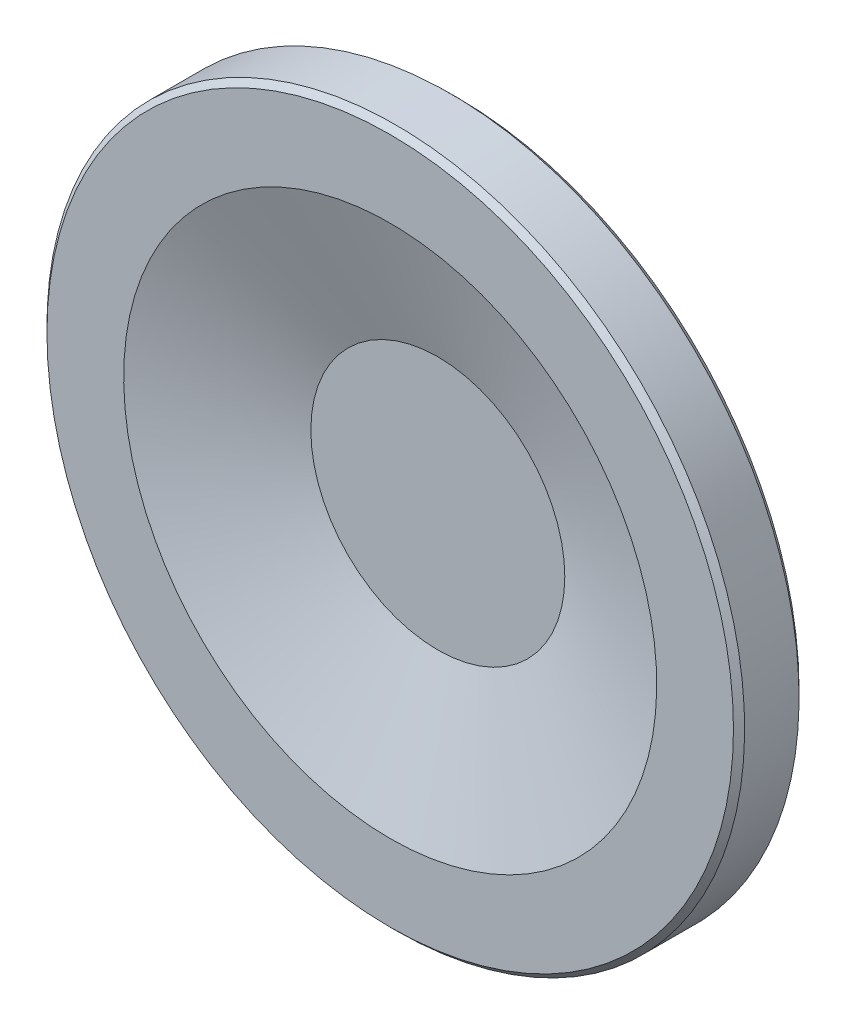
ISO-10303-21;
HEADER;
FILE_DESCRIPTION(('STEP AP214'),'2;1');
FILE_NAME('part.step','',(''),(''),'','','');
FILE_SCHEMA(('AUTOMOTIVE_DESIGN { 1 0 10303 214 1 1 1 1 }'));
ENDSEC;
DATA;
#1=APPLICATION_CONTEXT('core data for automotive mechanical design processes');
#2=APPLICATION_PROTOCOL_DEFINITION('international standard','automotive_design',2000,#1);
#3=PRODUCT_CONTEXT('',#1,'mechanical');
#4=PRODUCT('Part','Part','',(#3));
#5=PRODUCT_RELATED_PRODUCT_CATEGORY('part','',(#4));
#6=PRODUCT_DEFINITION_FORMATION('','',#4);
#7=PRODUCT_DEFINITION_CONTEXT('part definition',#1,'design');
#8=PRODUCT_DEFINITION('design','',#6,#7);
#9=PRODUCT_DEFINITION_SHAPE('','',#8);
#10=(LENGTH_UNIT() NAMED_UNIT(*) SI_UNIT(.MILLI.,.METRE.));
#11=(NAMED_UNIT(*) PLANE_ANGLE_UNIT() SI_UNIT($,.RADIAN.));
#12=(NAMED_UNIT(*) SI_UNIT($,.STERADIAN.) SOLID_ANGLE_UNIT());
#13=UNCERTAINTY_MEASURE_WITH_UNIT(LENGTH_MEASURE(1.E-05),#10,'distance_accuracy_value','');
#14=(GEOMETRIC_REPRESENTATION_CONTEXT(3) GLOBAL_UNCERTAINTY_ASSIGNED_CONTEXT((#13)) GLOBAL_UNIT_ASSIGNED_CONTEXT((#10,
#11,#12)) REPRESENTATION_CONTEXT('',''));
#15=CARTESIAN_POINT('',(0.,0.,0.));
#16=DIRECTION('',(0.,0.,1.));
#17=DIRECTION('',(1.,0.,0.));
#18=AXIS2_PLACEMENT_3D('',#15,#16,#17);
#19=CARTESIAN_POINT('',(0.,0.,62.));
#20=DIRECTION('',(0.,0.,-1.));
#21=DIRECTION('',(0.,1.,0.));
#22=AXIS2_PLACEMENT_3D('',#19,#20,#21);
#23=CONICAL_SURFACE('',#22,125.,0.785398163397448);
#24=CARTESIAN_POINT('',(0.,0.,64.));
#25=DIRECTION('',(0.,0.,1.));
#26=DIRECTION('',(0.,-1.,0.));
#27=AXIS2_PLACEMENT_3D('',#24,#25,#26);
#28=CIRCLE('',#27,123.);
#29=CARTESIAN_POINT('',(0.,-123.,64.0000000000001));
#30=VERTEX_POINT('',#29);
#31=EDGE_CURVE('E8',#30,#30,#28,.T.);
#32=ORIENTED_EDGE('',*,*,#31,.F.);
#33=EDGE_LOOP('',(#32));
#34=FACE_BOUND('',#33,.T.);
#35=CARTESIAN_POINT('',(0.,0.,62.));
#36=DIRECTION('',(0.,0.,1.));
#37=DIRECTION('',(0.,-1.,0.));
#38=AXIS2_PLACEMENT_3D('',#35,#36,#37);
#39=CIRCLE('',#38,125.);
#40=CARTESIAN_POINT('',(0.,-125.,62.0000000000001));
#41=VERTEX_POINT('',#40);
#42=EDGE_CURVE('E69',#41,#41,#39,.T.);
#43=ORIENTED_EDGE('',*,*,#42,.T.);
#44=EDGE_LOOP('',(#43));
#45=FACE_BOUND('',#44,.T.);
#46=ADVANCED_FACE('F13',(#34,#45),#23,.T.);
#47=CARTESIAN_POINT('',(0.,95.5,64.));
#48=DIRECTION('',(0.,0.,1.));
#49=DIRECTION('',(0.,-1.,0.));
#50=AXIS2_PLACEMENT_3D('',#47,#48,#49);
#51=PLANE('',#50);
#52=ORIENTED_EDGE('',*,*,#31,.T.);
#53=EDGE_LOOP('',(#52));
#54=FACE_BOUND('',#53,.T.);
#55=CARTESIAN_POINT('',(0.,0.,64.));
#56=DIRECTION('',(0.,0.,1.));
#57=DIRECTION('',(0.,-1.,0.));
#58=AXIS2_PLACEMENT_3D('',#55,#56,#57);
#59=CIRCLE('',#58,95.5);
#60=CARTESIAN_POINT('',(0.,-95.5,64.0000000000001));
#61=VERTEX_POINT('',#60);
#62=EDGE_CURVE('E20',#61,#61,#59,.T.);
#63=ORIENTED_EDGE('',*,*,#62,.F.);
#64=EDGE_LOOP('',(#63));
#65=FACE_BOUND('',#64,.T.);
#66=ADVANCED_FACE('F89',(#54,#65),#51,.T.);
#67=CARTESIAN_POINT('',(0.,0.,46.940239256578));
#68=DIRECTION('',(0.,0.,1.));
#69=DIRECTION('',(0.,-1.,0.));
#70=AXIS2_PLACEMENT_3D('',#67,#68,#69);
#71=CONICAL_SURFACE('',#70,45.5,1.24198684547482);
#72=ORIENTED_EDGE('',*,*,#62,.T.);
#73=EDGE_LOOP('',(#72));
#74=FACE_BOUND('',#73,.T.);
#75=CARTESIAN_POINT('',(0.,0.,46.940239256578));
#76=DIRECTION('',(0.,0.,1.));
#77=DIRECTION('',(0.,-1.,0.));
#78=AXIS2_PLACEMENT_3D('',#75,#76,#77);
#79=CIRCLE('',#78,45.5);
#80=CARTESIAN_POINT('',(0.,-45.5,46.940239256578));
#81=VERTEX_POINT('',#80);
#82=EDGE_CURVE('E26',#81,#81,#79,.T.);
#83=ORIENTED_EDGE('',*,*,#82,.F.);
#84=EDGE_LOOP('',(#83));
#85=FACE_BOUND('',#84,.T.);
#86=ADVANCED_FACE('F95',(#74,#85),#71,.F.);
#87=CARTESIAN_POINT('',(0.,0.,46.940239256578));
#88=DIRECTION('',(0.,0.,1.));
#89=DIRECTION('',(0.,-1.,0.));
#90=AXIS2_PLACEMENT_3D('',#87,#88,#89);
#91=PLANE('',#90);
#92=ORIENTED_EDGE('',*,*,#82,.T.);
#93=EDGE_LOOP('',(#92));
#94=FACE_BOUND('',#93,.T.);
#95=ADVANCED_FACE('F100',(#94),#91,.T.);
#96=CARTESIAN_POINT('',(0.,21.,0.));
#97=DIRECTION('',(0.,0.,-1.));
#98=DIRECTION('',(0.,1.,0.));
#99=AXIS2_PLACEMENT_3D('',#96,#97,#98);
#100=PLANE('',#99);
#101=CARTESIAN_POINT('',(0.,0.,0.));
#102=DIRECTION('',(0.,0.,1.));
#103=DIRECTION('',(0.,-1.,0.));
#104=AXIS2_PLACEMENT_3D('',#101,#102,#103);
#105=CIRCLE('',#104,21.);
#106=CARTESIAN_POINT('',(0.,-21.,0.));
#107=VERTEX_POINT('',#106);
#108=EDGE_CURVE('E31',#107,#107,#105,.T.);
#109=ORIENTED_EDGE('',*,*,#108,.F.);
#110=EDGE_LOOP('',(#109));
#111=FACE_BOUND('',#110,.T.);
#112=ADVANCED_FACE('F106',(#111),#100,.T.);
#113=CARTESIAN_POINT('',(0.,0.,1.));
#114=DIRECTION('',(0.,0.,1.));
#115=DIRECTION('',(0.,-1.,0.));
#116=AXIS2_PLACEMENT_3D('',#113,#114,#115);
#117=CONICAL_SURFACE('',#116,22.,0.785398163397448);
#118=ORIENTED_EDGE('',*,*,#108,.T.);
#119=EDGE_LOOP('',(#118));
#120=FACE_BOUND('',#119,.T.);
#121=CARTESIAN_POINT('',(0.,0.,1.));
#122=DIRECTION('',(0.,0.,1.));
#123=DIRECTION('',(0.,-1.,0.));
#124=AXIS2_PLACEMENT_3D('',#121,#122,#123);
#125=CIRCLE('',#124,22.);
#126=CARTESIAN_POINT('',(0.,-22.,1.00000000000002));
#127=VERTEX_POINT('',#126);
#128=EDGE_CURVE('E37',#127,#127,#125,.T.);
#129=ORIENTED_EDGE('',*,*,#128,.F.);
#130=EDGE_LOOP('',(#129));
#131=FACE_BOUND('',#130,.T.);
#132=ADVANCED_FACE('F110',(#120,#131),#117,.T.);
#133=CARTESIAN_POINT('',(0.,0.,84.));
#134=DIRECTION('',(0.,0.,1.));
#135=DIRECTION('',(0.,-1.,0.));
#136=AXIS2_PLACEMENT_3D('',#133,#134,#135);
#137=CYLINDRICAL_SURFACE('',#136,22.);
#138=ORIENTED_EDGE('',*,*,#128,.T.);
#139=EDGE_LOOP('',(#138));
#140=FACE_BOUND('',#139,.T.);
#141=CARTESIAN_POINT('',(0.,0.,19.));
#142=DIRECTION('',(0.,0.,1.));
#143=DIRECTION('',(0.,-1.,0.));
#144=AXIS2_PLACEMENT_3D('',#141,#142,#143);
#145=CIRCLE('',#144,22.);
#146=CARTESIAN_POINT('',(0.,-22.,19.));
#147=VERTEX_POINT('',#146);
#148=EDGE_CURVE('E41',#147,#147,#145,.T.);
#149=ORIENTED_EDGE('',*,*,#148,.F.);
#150=EDGE_LOOP('',(#149));
#151=FACE_BOUND('',#150,.T.);
#152=ADVANCED_FACE('F114',(#140,#151),#137,.T.);
#153=CARTESIAN_POINT('',(0.,27.5,19.));
#154=DIRECTION('',(0.,0.,-1.));
#155=DIRECTION('',(0.,1.,0.));
#156=AXIS2_PLACEMENT_3D('',#153,#154,#155);
#157=PLANE('',#156);
#158=ORIENTED_EDGE('',*,*,#148,.T.);
#159=EDGE_LOOP('',(#158));
#160=FACE_BOUND('',#159,.T.);
#161=CARTESIAN_POINT('',(0.,0.,19.));
#162=DIRECTION('',(0.,0.,1.));
#163=DIRECTION('',(0.,-1.,0.));
#164=AXIS2_PLACEMENT_3D('',#161,#162,#163);
#165=CIRCLE('',#164,27.5);
#166=CARTESIAN_POINT('',(0.,-27.5,19.));
#167=VERTEX_POINT('',#166);
#168=EDGE_CURVE('E45',#167,#167,#165,.T.);
#169=ORIENTED_EDGE('',*,*,#168,.F.);
#170=EDGE_LOOP('',(#169));
#171=FACE_BOUND('',#170,.T.);
#172=ADVANCED_FACE('F118',(#160,#171),#157,.T.);
#173=CARTESIAN_POINT('',(0.,0.,84.));
#174=DIRECTION('',(0.,0.,1.));
#175=DIRECTION('',(0.,-1.,0.));
#176=AXIS2_PLACEMENT_3D('',#173,#174,#175);
#177=CYLINDRICAL_SURFACE('',#176,27.5);
#178=ORIENTED_EDGE('',*,*,#168,.T.);
#179=EDGE_LOOP('',(#178));
#180=FACE_BOUND('',#179,.T.);
#181=CARTESIAN_POINT('',(0.,0.,24.3655325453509));
#182=DIRECTION('',(0.,0.,1.));
#183=DIRECTION('',(0.,-1.,0.));
#184=AXIS2_PLACEMENT_3D('',#181,#182,#183);
#185=CIRCLE('',#184,27.5);
#186=CARTESIAN_POINT('',(0.,-27.5,24.3655325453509));
#187=VERTEX_POINT('',#186);
#188=EDGE_CURVE('E49',#187,#187,#185,.T.);
#189=ORIENTED_EDGE('',*,*,#188,.F.);
#190=EDGE_LOOP('',(#189));
#191=FACE_BOUND('',#190,.T.);
#192=ADVANCED_FACE('F122',(#180,#191),#177,.T.);
#193=CARTESIAN_POINT('',(0.,0.,24.3655325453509));
#194=DIRECTION('',(0.,0.,1.));
#195=DIRECTION('',(0.,-1.,0.));
#196=AXIS2_PLACEMENT_3D('',#193,#194,#195);
#197=TOROIDAL_SURFACE('',#196,31.5,4.);
#198=ORIENTED_EDGE('',*,*,#188,.T.);
#199=EDGE_LOOP('',(#198));
#200=FACE_BOUND('',#199,.T.);
#201=CARTESIAN_POINT('',(0.,0.,28.098914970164));
#202=DIRECTION('',(0.,0.,1.));
#203=DIRECTION('',(0.,-1.,0.));
#204=AXIS2_PLACEMENT_3D('',#201,#202,#203);
#205=CIRCLE('',#204,30.0640836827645);
#206=CARTESIAN_POINT('',(0.,-30.0640836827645,28.098914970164));
#207=VERTEX_POINT('',#206);
#208=EDGE_CURVE('E53',#207,#207,#205,.T.);
#209=ORIENTED_EDGE('',*,*,#208,.F.);
#210=EDGE_LOOP('',(#209));
#211=FACE_BOUND('',#210,.T.);
#212=ADVANCED_FACE('F126',(#200,#211),#197,.F.);
#213=CARTESIAN_POINT('',(0.,0.,28.098914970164));
#214=DIRECTION('',(0.,0.,1.));
#215=DIRECTION('',(0.,-1.,0.));
#216=AXIS2_PLACEMENT_3D('',#213,#214,#215);
#217=CONICAL_SURFACE('',#216,30.0640836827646,1.20362249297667);
#218=CARTESIAN_POINT('',(0.,0.,40.));
#219=DIRECTION('',(0.,0.,1.));
#220=DIRECTION('',(0.,-1.,0.));
#221=AXIS2_PLACEMENT_3D('',#218,#219,#220);
#222=CIRCLE('',#221,61.0069047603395);
#223=CARTESIAN_POINT('',(0.,-61.0069047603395,40.0000000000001));
#224=VERTEX_POINT('',#223);
#225=EDGE_CURVE('E57',#224,#224,#222,.T.);
#226=ORIENTED_EDGE('',*,*,#225,.F.);
#227=EDGE_LOOP('',(#226));
#228=FACE_BOUND('',#227,.T.);
#229=ORIENTED_EDGE('',*,*,#208,.T.);
#230=EDGE_LOOP('',(#229));
#231=FACE_BOUND('',#230,.T.);
#232=ADVANCED_FACE('F130',(#228,#231),#217,.T.);
#233=CARTESIAN_POINT('',(0.,61.006904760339,40.));
#234=DIRECTION('',(0.,0.,1.));
#235=DIRECTION('',(0.,-1.,0.));
#236=AXIS2_PLACEMENT_3D('',#233,#234,#235);
#237=PLANE('',#236);
#238=CARTESIAN_POINT('',(0.,0.,40.));
#239=DIRECTION('',(0.,0.,1.));
#240=DIRECTION('',(0.,-1.,0.));
#241=AXIS2_PLACEMENT_3D('',#238,#239,#240);
#242=CIRCLE('',#241,122.5);
#243=CARTESIAN_POINT('',(0.,-122.5,40.0000000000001));
#244=VERTEX_POINT('',#243);
#245=EDGE_CURVE('E61',#244,#244,#242,.T.);
#246=ORIENTED_EDGE('',*,*,#245,.F.);
#247=EDGE_LOOP('',(#246));
#248=FACE_BOUND('',#247,.T.);
#249=ORIENTED_EDGE('',*,*,#225,.T.);
#250=EDGE_LOOP('',(#249));
#251=FACE_BOUND('',#250,.T.);
#252=ADVANCED_FACE('F85',(#248,#251),#237,.F.);
#253=CARTESIAN_POINT('',(0.,0.,42.5));
#254=DIRECTION('',(0.,0.,1.));
#255=DIRECTION('',(0.,-1.,0.));
#256=AXIS2_PLACEMENT_3D('',#253,#254,#255);
#257=CONICAL_SURFACE('',#256,125.,0.785398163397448);
#258=ORIENTED_EDGE('',*,*,#245,.T.);
#259=EDGE_LOOP('',(#258));
#260=FACE_BOUND('',#259,.T.);
#261=CARTESIAN_POINT('',(0.,0.,42.5));
#262=DIRECTION('',(0.,0.,1.));
#263=DIRECTION('',(0.,-1.,0.));
#264=AXIS2_PLACEMENT_3D('',#261,#262,#263);
#265=CIRCLE('',#264,125.);
#266=CARTESIAN_POINT('',(0.,-125.,42.5000000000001));
#267=VERTEX_POINT('',#266);
#268=EDGE_CURVE('E65',#267,#267,#265,.T.);
#269=ORIENTED_EDGE('',*,*,#268,.F.);
#270=EDGE_LOOP('',(#269));
#271=FACE_BOUND('',#270,.T.);
#272=ADVANCED_FACE('F77',(#260,#271),#257,.T.);
#273=CARTESIAN_POINT('',(0.,0.,84.));
#274=DIRECTION('',(0.,0.,1.));
#275=DIRECTION('',(0.,-1.,0.));
#276=AXIS2_PLACEMENT_3D('',#273,#274,#275);
#277=CYLINDRICAL_SURFACE('',#276,125.);
#278=ORIENTED_EDGE('',*,*,#268,.T.);
#279=EDGE_LOOP('',(#278));
#280=FACE_BOUND('',#279,.T.);
#281=ORIENTED_EDGE('',*,*,#42,.F.);
#282=EDGE_LOOP('',(#281));
#283=FACE_BOUND('',#282,.T.);
#284=ADVANCED_FACE('F75',(#280,#283),#277,.T.);
#285=CLOSED_SHELL('',(#46,#66,#86,#95,#112,#132,#152,#172,#192,#212,#232,#252,#272,#284));
#286=MANIFOLD_SOLID_BREP('B1',#285);
#287=ADVANCED_BREP_SHAPE_REPRESENTATION('',(#18,#286),#14);
#288=SHAPE_DEFINITION_REPRESENTATION(#9,#287);
ENDSEC;
END-ISO-10303-21;
